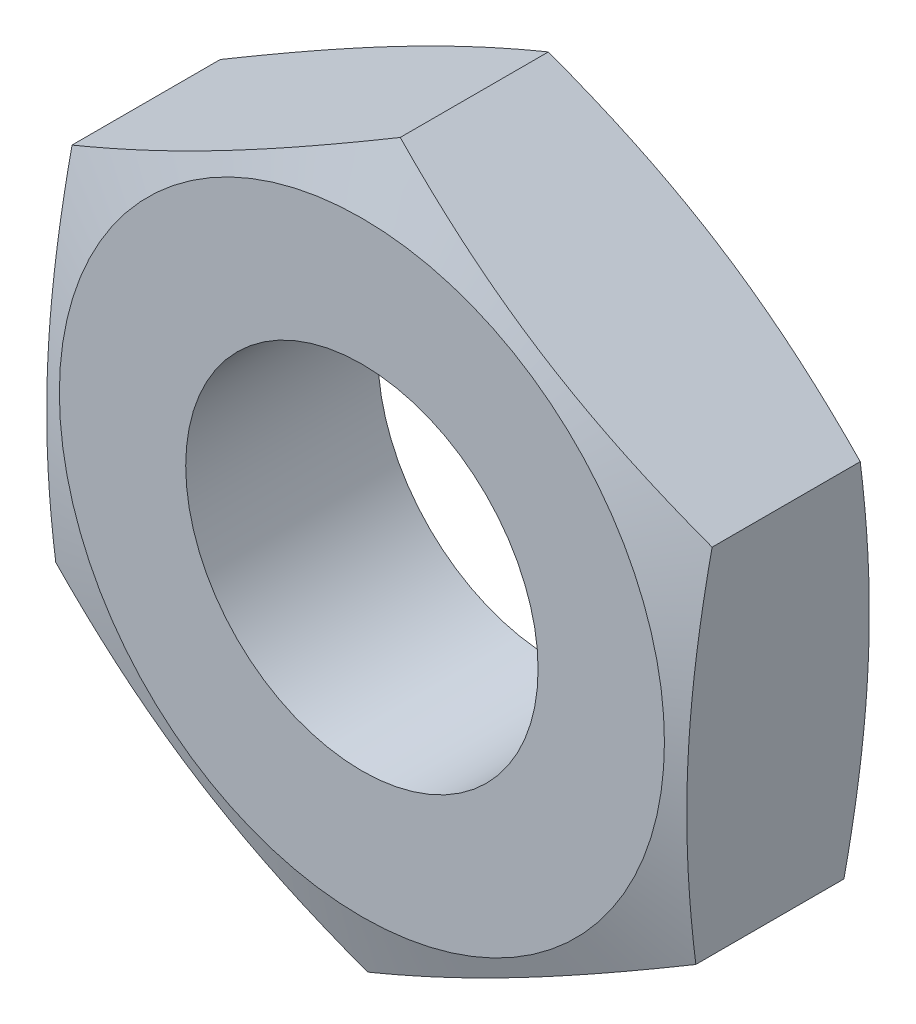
ISO-10303-21;
HEADER;
FILE_DESCRIPTION(('STEP AP214'),'2;1');
FILE_NAME('part.step','',(''),(''),'','','');
FILE_SCHEMA(('AUTOMOTIVE_DESIGN { 1 0 10303 214 1 1 1 1 }'));
ENDSEC;
DATA;
#1=APPLICATION_CONTEXT('core data for automotive mechanical design processes');
#2=APPLICATION_PROTOCOL_DEFINITION('international standard','automotive_design',2000,#1);
#3=PRODUCT_CONTEXT('',#1,'mechanical');
#4=PRODUCT('Part','Part','',(#3));
#5=PRODUCT_RELATED_PRODUCT_CATEGORY('part','',(#4));
#6=PRODUCT_DEFINITION_FORMATION('','',#4);
#7=PRODUCT_DEFINITION_CONTEXT('part definition',#1,'design');
#8=PRODUCT_DEFINITION('design','',#6,#7);
#9=PRODUCT_DEFINITION_SHAPE('','',#8);
#10=(LENGTH_UNIT() NAMED_UNIT(*) SI_UNIT(.MILLI.,.METRE.));
#11=(NAMED_UNIT(*) PLANE_ANGLE_UNIT() SI_UNIT($,.RADIAN.));
#12=(NAMED_UNIT(*) SI_UNIT($,.STERADIAN.) SOLID_ANGLE_UNIT());
#13=UNCERTAINTY_MEASURE_WITH_UNIT(LENGTH_MEASURE(1.E-05),#10,'distance_accuracy_value','');
#14=(GEOMETRIC_REPRESENTATION_CONTEXT(3) GLOBAL_UNCERTAINTY_ASSIGNED_CONTEXT((#13)) GLOBAL_UNIT_ASSIGNED_CONTEXT((#10,
#11,#12)) REPRESENTATION_CONTEXT('',''));
#15=CARTESIAN_POINT('',(0.,0.,0.));
#16=DIRECTION('',(0.,0.,1.));
#17=DIRECTION('',(1.,0.,0.));
#18=AXIS2_PLACEMENT_3D('',#15,#16,#17);
#19=CARTESIAN_POINT('',(-38.9,6.,-25.446020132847));
#20=DIRECTION('',(0.,0.,-1.));
#21=DIRECTION('',(-1.,0.,0.));
#22=AXIS2_PLACEMENT_3D('',#19,#20,#21);
#23=CONICAL_SURFACE('',#22,5.77981137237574,1.25464201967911);
#24=CARTESIAN_POINT('',(-38.9,6.,-25.0999999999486));
#25=DIRECTION('',(0.,0.,-1.));
#26=DIRECTION('',(-1.,0.,0.));
#27=AXIS2_PLACEMENT_3D('',#24,#25,#26);
#28=CIRCLE('',#27,4.72205597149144);
#29=CARTESIAN_POINT('',(-43.6220559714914,6.,-25.0999999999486));
#30=VERTEX_POINT('',#29);
#31=EDGE_CURVE('E93',#30,#30,#28,.F.);
#32=ORIENTED_EDGE('',*,*,#31,.F.);
#33=EDGE_LOOP('',(#32));
#34=FACE_BOUND('',#33,.T.);
#35=CARTESIAN_POINT('',(-33.7777723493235,8.66385383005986,-25.4439563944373));
#36=CARTESIAN_POINT('',(-33.7789109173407,8.63801402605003,-25.4397259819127));
#37=CARTESIAN_POINT('',(-33.7800497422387,8.61216839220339,-25.4355370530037));
#38=CARTESIAN_POINT('',(-33.7823275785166,8.5604728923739,-25.4272456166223));
#39=CARTESIAN_POINT('',(-33.7834665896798,8.53462303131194,-25.4231430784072));
#40=CARTESIAN_POINT('',(-33.8049246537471,8.04763221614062,-25.3466951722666));
#41=CARTESIAN_POINT('',(-33.8253520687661,7.58403198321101,-25.2881106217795));
#42=CARTESIAN_POINT('',(-33.8561012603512,6.88617900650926,-25.2289345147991));
#43=CARTESIAN_POINT('',(-33.8663717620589,6.65308994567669,-25.2139924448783));
#44=CARTESIAN_POINT('',(-33.8869317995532,6.18647984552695,-25.1945847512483));
#45=CARTESIAN_POINT('',(-33.8972213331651,5.95295885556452,-25.190117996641));
#46=CARTESIAN_POINT('',(-33.9179225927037,5.48314372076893,-25.191978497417));
#47=CARTESIAN_POINT('',(-33.9283342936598,5.24685014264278,-25.1984367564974));
#48=CARTESIAN_POINT('',(-33.9491363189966,4.77474812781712,-25.2219573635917));
#49=CARTESIAN_POINT('',(-33.9595266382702,4.53893980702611,-25.2390220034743));
#50=CARTESIAN_POINT('',(-33.9802815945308,4.06790602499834,-25.2827352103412));
#51=CARTESIAN_POINT('',(-33.9906461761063,3.83268182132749,-25.309397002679));
#52=CARTESIAN_POINT('',(-34.0113231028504,3.36341891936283,-25.3708950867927));
#53=CARTESIAN_POINT('',(-34.0216354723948,3.129379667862,-25.405727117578));
#54=CARTESIAN_POINT('',(-34.0319210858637,2.89594764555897,-25.4439563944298));
#55=B_SPLINE_CURVE_WITH_KNOTS('',3,(#35,#36,#37,#38,#39,#40,#41,#42,#43,#44,#45,#46,#47,#48,#49,
#50,#51,#52,#53,#54),.UNSPECIFIED.,.F.,.F.,(4,2,2,2,2,2,2,2,2,4),(0.,0.0786237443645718,
0.157219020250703,1.5588520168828,2.2600434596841,2.96115919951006,3.67074186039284,
4.38047790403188,5.09119576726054,5.80154379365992),.UNSPECIFIED.);
#56=CARTESIAN_POINT('',(-33.7777723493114,8.66385383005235,-25.4439563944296));
#57=VERTEX_POINT('',#56);
#58=CARTESIAN_POINT('',(-34.0319210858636,2.89594764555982,-25.4439563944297));
#59=VERTEX_POINT('',#58);
#60=EDGE_CURVE('E103',#57,#59,#55,.T.);
#61=ORIENTED_EDGE('',*,*,#60,.F.);
#62=CARTESIAN_POINT('',(-38.6458512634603,11.7679061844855,-25.4439563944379));
#63=CARTESIAN_POINT('',(-38.4440191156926,11.6392111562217,-25.4047902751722));
#64=CARTESIAN_POINT('',(-38.2416461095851,11.5101712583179,-25.3691920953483));
#65=CARTESIAN_POINT('',(-37.8358362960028,11.2514131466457,-25.3065991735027));
#66=CARTESIAN_POINT('',(-37.6323989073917,11.1216945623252,-25.2796097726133));
#67=CARTESIAN_POINT('',(-37.2262900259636,10.8627457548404,-25.2359221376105));
#68=CARTESIAN_POINT('',(-37.0236246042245,10.7335194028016,-25.2191466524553));
#69=CARTESIAN_POINT('',(-36.6179099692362,10.4748219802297,-25.1966486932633));
#70=CARTESIAN_POINT('',(-36.4148608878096,10.3453509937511,-25.1909229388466));
#71=CARTESIAN_POINT('',(-36.0087627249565,10.0864090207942,-25.1909229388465));
#72=CARTESIAN_POINT('',(-35.8057136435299,9.95693803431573,-25.1966486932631));
#73=CARTESIAN_POINT('',(-35.3999990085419,9.69824061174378,-25.2191466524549));
#74=CARTESIAN_POINT('',(-35.1973335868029,9.56901425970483,-25.2359221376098));
#75=CARTESIAN_POINT('',(-34.7912247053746,9.31006545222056,-25.2796097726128));
#76=CARTESIAN_POINT('',(-34.5877873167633,9.18034686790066,-25.3065991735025));
#77=CARTESIAN_POINT('',(-34.181977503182,8.92158875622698,-25.3691920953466));
#78=CARTESIAN_POINT('',(-33.9796044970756,8.79254885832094,-25.4047902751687));
#79=CARTESIAN_POINT('',(-33.7777723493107,8.6638538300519,-25.4439563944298));
#80=B_SPLINE_CURVE_WITH_KNOTS('',3,(#62,#63,#64,#65,#66,#67,#68,#69,#70,#71,#72,#73,#74,#75,#76,
#77,#78,#79),.UNSPECIFIED.,.F.,.F.,(4,2,2,2,2,2,2,2,4),(0.,0.727722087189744,1.45589479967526,
2.17848939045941,2.90086942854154,3.62324946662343,4.34584405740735,5.07401676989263,
5.80173885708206),.UNSPECIFIED.);
#81=CARTESIAN_POINT('',(-38.645851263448,11.7679061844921,-25.4439563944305));
#82=VERTEX_POINT('',#81);
#83=EDGE_CURVE('E107',#82,#57,#80,.T.);
#84=ORIENTED_EDGE('',*,*,#83,.F.);
#85=CARTESIAN_POINT('',(-43.7680789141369,9.10405235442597,-25.4439563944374));
#86=CARTESIAN_POINT('',(-43.5557096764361,9.21449660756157,-25.4047902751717));
#87=CARTESIAN_POINT('',(-43.342771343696,9.32523682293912,-25.3691920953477));
#88=CARTESIAN_POINT('',(-42.9157753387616,9.54729937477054,-25.3065991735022));
#89=CARTESIAN_POINT('',(-42.7017170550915,9.65862202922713,-25.2796097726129));
#90=CARTESIAN_POINT('',(-42.274406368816,9.88084823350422,-25.2359221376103));
#91=CARTESIAN_POINT('',(-42.0611603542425,9.99174846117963,-25.2191466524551));
#92=CARTESIAN_POINT('',(-41.6342644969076,10.2137589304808,-25.1966486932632));
#93=CARTESIAN_POINT('',(-41.420614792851,10.3248690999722,-25.1909229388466));
#94=CARTESIAN_POINT('',(-40.9933153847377,10.5470894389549,-25.1909229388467));
#95=CARTESIAN_POINT('',(-40.7796656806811,10.6581996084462,-25.1966486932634));
#96=CARTESIAN_POINT('',(-40.3527698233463,10.8802100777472,-25.2191466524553));
#97=CARTESIAN_POINT('',(-40.1395238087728,10.9911103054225,-25.2359221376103));
#98=CARTESIAN_POINT('',(-39.7122131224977,11.2133365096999,-25.2796097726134));
#99=CARTESIAN_POINT('',(-39.4981548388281,11.324659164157,-25.3065991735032));
#100=CARTESIAN_POINT('',(-39.0711588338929,11.5467217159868,-25.3691920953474));
#101=CARTESIAN_POINT('',(-38.8582205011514,11.6574619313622,-25.4047902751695));
#102=CARTESIAN_POINT('',(-38.6458512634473,11.7679061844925,-25.4439563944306));
#103=B_SPLINE_CURVE_WITH_KNOTS('',3,(#85,#86,#87,#88,#89,#90,#91,#92,#93,#94,#95,#96,#97,#98,
#99,#100,#101,#102),.UNSPECIFIED.,.F.,.F.,(4,2,2,2,2,2,2,2,4),(0.,0.727722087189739,
1.45589479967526,2.17848939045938,2.90086942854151,3.62324946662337,4.34584405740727,
5.07401676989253,5.80173885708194),.UNSPECIFIED.);
#104=CARTESIAN_POINT('',(-43.7680789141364,9.10405235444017,-25.4439563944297));
#105=VERTEX_POINT('',#104);
#106=EDGE_CURVE('E82',#105,#82,#103,.T.);
#107=ORIENTED_EDGE('',*,*,#106,.F.);
#108=CARTESIAN_POINT('',(-44.0222276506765,3.33614616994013,-25.4439563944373));
#109=CARTESIAN_POINT('',(-44.0210890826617,3.36198597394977,-25.4397259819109));
#110=CARTESIAN_POINT('',(-44.0199502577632,3.38783160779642,-25.4355370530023));
#111=CARTESIAN_POINT('',(-44.0176724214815,3.43952710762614,-25.4272456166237));
#112=CARTESIAN_POINT('',(-44.0165334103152,3.46537696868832,-25.4231430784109));
#113=CARTESIAN_POINT('',(-43.9950753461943,3.9523677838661,-25.3466951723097));
#114=CARTESIAN_POINT('',(-43.974647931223,4.4159680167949,-25.2881106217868));
#115=CARTESIAN_POINT('',(-43.9438987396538,5.11382099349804,-25.2289345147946));
#116=CARTESIAN_POINT('',(-43.9336282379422,5.34691005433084,-25.2139924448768));
#117=CARTESIAN_POINT('',(-43.9130682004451,5.81352015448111,-25.1945847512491));
#118=CARTESIAN_POINT('',(-43.9027786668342,6.04704114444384,-25.1901179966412));
#119=CARTESIAN_POINT('',(-43.8820774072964,6.5168562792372,-25.1919784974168));
#120=CARTESIAN_POINT('',(-43.8716657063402,6.75314985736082,-25.1984367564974));
#121=CARTESIAN_POINT('',(-43.8508636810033,7.22525187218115,-25.2219573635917));
#122=CARTESIAN_POINT('',(-43.84047336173,7.46106019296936,-25.239022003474));
#123=CARTESIAN_POINT('',(-43.8197184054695,7.93209397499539,-25.2827352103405));
#124=CARTESIAN_POINT('',(-43.809353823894,8.16731817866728,-25.3093970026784));
#125=CARTESIAN_POINT('',(-43.7886768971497,8.63658108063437,-25.3708950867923));
#126=CARTESIAN_POINT('',(-43.7783645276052,8.8706203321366,-25.4057271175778));
#127=CARTESIAN_POINT('',(-43.7680789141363,9.10405235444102,-25.4439563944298));
#128=B_SPLINE_CURVE_WITH_KNOTS('',3,(#108,#109,#110,#111,#112,#113,#114,#115,#116,#117,#118,
#119,#120,#121,#122,#123,#124,#125,#126,#127),.UNSPECIFIED.,.F.,.F.,(4,2,2,2,2,2,2,2,2,4),(0.,
0.0786237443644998,0.15721902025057,1.55885201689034,2.26004345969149,2.96115919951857,
3.67074186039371,4.38047790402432,5.0911957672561,5.8015437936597),.UNSPECIFIED.);
#129=CARTESIAN_POINT('',(-44.0222276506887,3.33614616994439,-25.4439563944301));
#130=VERTEX_POINT('',#129);
#131=EDGE_CURVE('E21',#130,#105,#128,.T.);
#132=ORIENTED_EDGE('',*,*,#131,.F.);
#133=CARTESIAN_POINT('',(-39.1541487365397,0.232093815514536,-25.4439563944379));
#134=CARTESIAN_POINT('',(-39.3559808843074,0.360788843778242,-25.4047902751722));
#135=CARTESIAN_POINT('',(-39.5583538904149,0.489828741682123,-25.3691920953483));
#136=CARTESIAN_POINT('',(-39.9641637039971,0.748586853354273,-25.3065991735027));
#137=CARTESIAN_POINT('',(-40.1676010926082,0.878305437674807,-25.2796097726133));
#138=CARTESIAN_POINT('',(-40.5737099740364,1.13725424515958,-25.2359221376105));
#139=CARTESIAN_POINT('',(-40.7763753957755,1.26648059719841,-25.2191466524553));
#140=CARTESIAN_POINT('',(-41.1820900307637,1.52517801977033,-25.1966486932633));
#141=CARTESIAN_POINT('',(-41.3851391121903,1.65464900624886,-25.1909229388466));
#142=CARTESIAN_POINT('',(-41.7912372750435,1.91359097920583,-25.1909229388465));
#143=CARTESIAN_POINT('',(-41.99428635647,2.04306196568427,-25.1966486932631));
#144=CARTESIAN_POINT('',(-42.4000009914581,2.30175938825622,-25.2191466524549));
#145=CARTESIAN_POINT('',(-42.602666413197,2.43098574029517,-25.2359221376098));
#146=CARTESIAN_POINT('',(-43.0087752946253,2.68993454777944,-25.2796097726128));
#147=CARTESIAN_POINT('',(-43.2122126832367,2.81965313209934,-25.3065991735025));
#148=CARTESIAN_POINT('',(-43.618022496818,3.07841124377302,-25.3691920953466));
#149=CARTESIAN_POINT('',(-43.8203955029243,3.20745114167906,-25.4047902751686));
#150=CARTESIAN_POINT('',(-44.0222276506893,3.3361461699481,-25.4439563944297));
#151=B_SPLINE_CURVE_WITH_KNOTS('',3,(#133,#134,#135,#136,#137,#138,#139,#140,#141,#142,#143,
#144,#145,#146,#147,#148,#149,#150),.UNSPECIFIED.,.F.,.F.,(4,2,2,2,2,2,2,2,4),(0.,
0.727722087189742,1.45589479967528,2.17848939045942,2.90086942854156,3.62324946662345,
4.34584405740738,5.07401676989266,5.80173885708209),.UNSPECIFIED.);
#152=CARTESIAN_POINT('',(-39.154148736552,0.232093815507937,-25.4439563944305));
#153=VERTEX_POINT('',#152);
#154=EDGE_CURVE('E80',#153,#130,#151,.T.);
#155=ORIENTED_EDGE('',*,*,#154,.F.);
#156=CARTESIAN_POINT('',(-34.0319210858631,2.89594764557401,-25.4439563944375));
#157=CARTESIAN_POINT('',(-34.2442903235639,2.78550339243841,-25.4047902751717));
#158=CARTESIAN_POINT('',(-34.457228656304,2.67476317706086,-25.3691920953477));
#159=CARTESIAN_POINT('',(-34.8842246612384,2.45270062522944,-25.3065991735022));
#160=CARTESIAN_POINT('',(-35.0982829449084,2.34137797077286,-25.2796097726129));
#161=CARTESIAN_POINT('',(-35.525593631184,2.11915176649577,-25.2359221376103));
#162=CARTESIAN_POINT('',(-35.7388396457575,2.00825153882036,-25.2191466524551));
#163=CARTESIAN_POINT('',(-36.1657355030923,1.78624106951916,-25.1966486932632));
#164=CARTESIAN_POINT('',(-36.379385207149,1.67513090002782,-25.1909229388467));
#165=CARTESIAN_POINT('',(-36.8066846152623,1.45291056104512,-25.1909229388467));
#166=CARTESIAN_POINT('',(-37.0203343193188,1.34180039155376,-25.1966486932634));
#167=CARTESIAN_POINT('',(-37.4472301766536,1.11978992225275,-25.2191466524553));
#168=CARTESIAN_POINT('',(-37.6604761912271,1.00888969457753,-25.2359221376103));
#169=CARTESIAN_POINT('',(-38.0877868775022,0.786663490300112,-25.2796097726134));
#170=CARTESIAN_POINT('',(-38.3018451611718,0.675340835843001,-25.3065991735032));
#171=CARTESIAN_POINT('',(-38.728841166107,0.453278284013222,-25.3691920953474));
#172=CARTESIAN_POINT('',(-38.9417794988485,0.342538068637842,-25.4047902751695));
#173=CARTESIAN_POINT('',(-39.1541487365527,0.232093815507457,-25.4439563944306));
#174=B_SPLINE_CURVE_WITH_KNOTS('',3,(#156,#157,#158,#159,#160,#161,#162,#163,#164,#165,#166,
#167,#168,#169,#170,#171,#172,#173),.UNSPECIFIED.,.F.,.F.,(4,2,2,2,2,2,2,2,4),(0.,
0.727722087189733,1.45589479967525,2.17848939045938,2.90086942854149,3.62324946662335,
4.34584405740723,5.07401676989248,5.80173885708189),.UNSPECIFIED.);
#175=EDGE_CURVE('E99',#59,#153,#174,.T.);
#176=ORIENTED_EDGE('',*,*,#175,.F.);
#177=EDGE_LOOP('',(#61,#84,#107,#132,#155,#176));
#178=FACE_BOUND('',#177,.T.);
#179=ADVANCED_FACE('F17',(#34,#178),#23,.T.);
#180=CARTESIAN_POINT('',(-43.7680789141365,9.10405235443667,-28.1));
#181=DIRECTION('',(-0.999030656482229,0.0440198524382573,0.));
#182=DIRECTION('',(-0.0440198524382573,-0.999030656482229,0.));
#183=AXIS2_PLACEMENT_3D('',#180,#181,#182);
#184=PLANE('',#183);
#185=ORIENTED_EDGE('',*,*,#131,.T.);
#186=DIRECTION('',(0.,0.,1.));
#187=VECTOR('',#186,1.);
#188=CARTESIAN_POINT('',(-43.7680789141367,9.10405235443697,-28.1));
#189=LINE('',#188,#187);
#190=CARTESIAN_POINT('',(-43.7680789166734,9.10405229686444,-27.7560436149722));
#191=VERTEX_POINT('',#190);
#192=EDGE_CURVE('E84',#191,#105,#189,.T.);
#193=ORIENTED_EDGE('',*,*,#192,.F.);
#194=CARTESIAN_POINT('',(-44.0222276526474,3.3361461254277,-27.7560435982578));
#195=CARTESIAN_POINT('',(-44.0210890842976,3.36198593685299,-27.7602740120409));
#196=CARTESIAN_POINT('',(-44.0199502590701,3.38783157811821,-27.7644629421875));
#197=CARTESIAN_POINT('',(-44.0176724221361,3.43952709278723,-27.7727543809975));
#198=CARTESIAN_POINT('',(-44.0165334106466,3.46537696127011,-27.7768569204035));
#199=CARTESIAN_POINT('',(-43.9950753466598,3.95236777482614,-27.853304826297));
#200=CARTESIAN_POINT('',(-43.9746479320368,4.41596799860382,-27.9118893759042));
#201=CARTESIAN_POINT('',(-43.9438987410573,5.11382096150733,-27.97106548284));
#202=CARTESIAN_POINT('',(-43.9336282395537,5.34691001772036,-27.9860075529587));
#203=CARTESIAN_POINT('',(-43.9130682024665,5.81352010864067,-28.0054152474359));
#204=CARTESIAN_POINT('',(-43.9027786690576,6.0470410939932,-28.0098820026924));
#205=CARTESIAN_POINT('',(-43.88207740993,6.51685621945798,-28.0080215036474));
#206=CARTESIAN_POINT('',(-43.871665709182,6.75314979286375,-28.0015632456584));
#207=CARTESIAN_POINT('',(-43.8508636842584,7.22525179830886,-27.9780426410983));
#208=CARTESIAN_POINT('',(-43.8404733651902,7.46106011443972,-27.9609780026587));
#209=CARTESIAN_POINT('',(-43.8197184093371,7.93209388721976,-27.9172647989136));
#210=CARTESIAN_POINT('',(-43.8093538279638,8.1673180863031,-27.8906030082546));
#211=CARTESIAN_POINT('',(-43.7886769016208,8.63658097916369,-27.8291049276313));
#212=CARTESIAN_POINT('',(-43.7783645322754,8.87062022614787,-27.7942728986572));
#213=CARTESIAN_POINT('',(-43.7680789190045,9.10405224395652,-27.7560436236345));
#214=B_SPLINE_CURVE_WITH_KNOTS('',3,(#194,#195,#196,#197,#198,#199,#200,#201,#202,#203,#204,
#205,#206,#207,#208,#209,#210,#211,#212,#213),.UNSPECIFIED.,.F.,.F.,(4,2,2,2,2,2,2,2,2,4),(0.,
0.0786237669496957,0.157219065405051,1.55885203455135,2.26004346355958,2.96115918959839,
3.67074183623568,4.38047786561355,5.09119571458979,5.8015437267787),.UNSPECIFIED.);
#215=CARTESIAN_POINT('',(-44.0222276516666,3.3361461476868,-27.7560436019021));
#216=VERTEX_POINT('',#215);
#217=EDGE_CURVE('E38',#216,#191,#214,.T.);
#218=ORIENTED_EDGE('',*,*,#217,.F.);
#219=DIRECTION('',(0.,0.,1.));
#220=VECTOR('',#219,1.);
#221=CARTESIAN_POINT('',(-44.0222276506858,3.33614616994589,-28.1));
#222=LINE('',#221,#220);
#223=EDGE_CURVE('E89',#130,#216,#222,.F.);
#224=ORIENTED_EDGE('',*,*,#223,.F.);
#225=EDGE_LOOP('',(#185,#193,#218,#224));
#226=FACE_BOUND('',#225,.T.);
#227=ADVANCED_FACE('F92',(#226),#184,.T.);
#228=CARTESIAN_POINT('',(-38.6458512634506,11.7679061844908,-28.1));
#229=DIRECTION('',(-0.461393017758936,0.887195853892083,0.));
#230=DIRECTION('',(-0.887195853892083,-0.461393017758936,0.));
#231=AXIS2_PLACEMENT_3D('',#228,#229,#230);
#232=PLANE('',#231);
#233=ORIENTED_EDGE('',*,*,#106,.T.);
#234=DIRECTION('',(0.,0.,1.));
#235=VECTOR('',#234,1.);
#236=CARTESIAN_POINT('',(-38.6458512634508,11.7679061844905,-28.1));
#237=LINE('',#236,#235);
#238=CARTESIAN_POINT('',(-38.645851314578,11.7679061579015,-27.7560436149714));
#239=VERTEX_POINT('',#238);
#240=EDGE_CURVE('E108',#239,#82,#237,.T.);
#241=ORIENTED_EDGE('',*,*,#240,.F.);
#242=CARTESIAN_POINT('',(-43.7680789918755,9.10405231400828,-27.7560435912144));
#243=CARTESIAN_POINT('',(-43.5557097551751,9.21449656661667,-27.7952097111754));
#244=CARTESIAN_POINT('',(-43.3427714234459,9.32523678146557,-27.8308078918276));
#245=CARTESIAN_POINT('',(-42.9157754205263,9.54729933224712,-27.893400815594));
#246=CARTESIAN_POINT('',(-42.70171713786,9.65862198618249,-27.9203902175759));
#247=CARTESIAN_POINT('',(-42.2744064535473,9.88084818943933,-27.964077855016));
#248=CARTESIAN_POINT('',(-42.0611604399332,9.99174841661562,-27.9808533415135));
#249=CARTESIAN_POINT('',(-41.6342645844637,10.2137588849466,-28.0033513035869));
#250=CARTESIAN_POINT('',(-41.420614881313,10.3248690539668,-28.0090770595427));
#251=CARTESIAN_POINT('',(-40.9933154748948,10.547089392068,-28.0090770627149));
#252=CARTESIAN_POINT('',(-40.7796657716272,10.658199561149,-28.0033513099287));
#253=CARTESIAN_POINT('',(-40.3527699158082,10.8802100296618,-27.9808533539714));
#254=CARTESIAN_POINT('',(-40.1395239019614,10.991110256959,-27.9640778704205));
#255=CARTESIAN_POINT('',(-39.7122132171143,11.2133364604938,-27.9203902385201));
#256=CARTESIAN_POINT('',(-39.4981549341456,11.3246591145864,-27.8934008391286));
#257=CARTESIAN_POINT('',(-39.0711589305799,11.546721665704,-27.8308079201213));
#258=CARTESIAN_POINT('',(-38.8582205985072,11.6574618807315,-27.7952097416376));
#259=CARTESIAN_POINT('',(-38.6458513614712,11.7679061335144,-27.7560436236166));
#260=B_SPLINE_CURVE_WITH_KNOTS('',3,(#242,#243,#244,#245,#246,#247,#248,#249,#250,#251,#252,
#253,#254,#255,#256,#257,#258,#259),.UNSPECIFIED.,.F.,.F.,(4,2,2,2,2,2,2,2,4),(0.,
0.727722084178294,1.45589479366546,2.17848938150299,2.90086941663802,3.62324945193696,
4.34584403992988,5.07401674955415,5.80173883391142),.UNSPECIFIED.);
#261=EDGE_CURVE('E184',#191,#239,#260,.T.);
#262=ORIENTED_EDGE('',*,*,#261,.F.);
#263=ORIENTED_EDGE('',*,*,#192,.T.);
#264=EDGE_LOOP('',(#233,#241,#262,#263));
#265=FACE_BOUND('',#264,.T.);
#266=ADVANCED_FACE('F193',(#265),#232,.T.);
#267=CARTESIAN_POINT('',(-33.7777723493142,8.6638538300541,-28.1));
#268=DIRECTION('',(0.537637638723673,0.843176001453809,0.));
#269=DIRECTION('',(-0.843176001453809,0.537637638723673,0.));
#270=AXIS2_PLACEMENT_3D('',#267,#268,#269);
#271=PLANE('',#270);
#272=ORIENTED_EDGE('',*,*,#83,.T.);
#273=DIRECTION('',(0.,0.,1.));
#274=VECTOR('',#273,1.);
#275=CARTESIAN_POINT('',(-33.7777723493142,8.6638538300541,-28.1));
#276=LINE('',#275,#274);
#277=CARTESIAN_POINT('',(-33.7777723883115,8.6638538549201,-27.7560436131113));
#278=VERTEX_POINT('',#277);
#279=EDGE_CURVE('E104',#278,#57,#276,.T.);
#280=ORIENTED_EDGE('',*,*,#279,.F.);
#281=CARTESIAN_POINT('',(-38.6458513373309,11.7679062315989,-27.756043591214));
#282=CARTESIAN_POINT('',(-38.4440191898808,11.6392112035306,-27.7952097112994));
#283=CARTESIAN_POINT('',(-38.2416461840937,11.5101713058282,-27.8308078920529));
#284=CARTESIAN_POINT('',(-37.8358363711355,11.2514131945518,-27.893400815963));
#285=CARTESIAN_POINT('',(-37.632398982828,11.1216946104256,-27.920390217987));
#286=CARTESIAN_POINT('',(-37.226290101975,10.8627458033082,-27.9640778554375));
#287=CARTESIAN_POINT('',(-37.0236246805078,10.7335194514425,-27.9808533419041));
#288=CARTESIAN_POINT('',(-36.6179100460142,10.4748220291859,-28.0033513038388));
#289=CARTESIAN_POINT('',(-36.4148609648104,10.3453510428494,-28.0090770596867));
#290=CARTESIAN_POINT('',(-36.0087628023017,10.0864090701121,-28.0090770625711));
#291=CARTESIAN_POINT('',(-35.8057137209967,9.9569380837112,-28.0033513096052));
#292=CARTESIAN_POINT('',(-35.3999990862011,9.69824066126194,-27.9808533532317));
#293=CARTESIAN_POINT('',(-35.1973336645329,9.56901430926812,-27.9640778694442));
#294=CARTESIAN_POINT('',(-34.7912247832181,9.31006550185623,-27.9203902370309));
#295=CARTESIAN_POINT('',(-34.5877873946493,9.1803469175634,-27.8934008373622));
#296=CARTESIAN_POINT('',(-34.1819775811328,8.92158880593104,-27.8308079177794));
#297=CARTESIAN_POINT('',(-33.9796045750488,8.79254890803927,-27.7952097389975));
#298=CARTESIAN_POINT('',(-33.7777724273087,8.6638538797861,-27.7560436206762));
#299=B_SPLINE_CURVE_WITH_KNOTS('',3,(#281,#282,#283,#284,#285,#286,#287,#288,#289,#290,#291,
#292,#293,#294,#295,#296,#297,#298),.UNSPECIFIED.,.F.,.F.,(4,2,2,2,2,2,2,2,4),(0.,
0.727722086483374,1.45589479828,2.17848938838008,2.90086942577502,3.62324946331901,
4.34584405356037,5.07401676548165,5.80173885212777),.UNSPECIFIED.);
#300=EDGE_CURVE('E177',#239,#278,#299,.T.);
#301=ORIENTED_EDGE('',*,*,#300,.F.);
#302=ORIENTED_EDGE('',*,*,#240,.T.);
#303=EDGE_LOOP('',(#272,#280,#301,#302));
#304=FACE_BOUND('',#303,.T.);
#305=ADVANCED_FACE('F166',(#304),#271,.T.);
#306=CARTESIAN_POINT('',(-34.0319210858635,2.89594764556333,-28.1));
#307=DIRECTION('',(0.999030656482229,-0.0440198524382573,0.));
#308=DIRECTION('',(0.0440198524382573,0.999030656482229,0.));
#309=AXIS2_PLACEMENT_3D('',#306,#307,#308);
#310=PLANE('',#309);
#311=ORIENTED_EDGE('',*,*,#60,.T.);
#312=DIRECTION('',(0.,0.,1.));
#313=VECTOR('',#312,1.);
#314=CARTESIAN_POINT('',(-34.0319210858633,2.89594764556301,-28.1));
#315=LINE('',#314,#313);
#316=CARTESIAN_POINT('',(-34.0319210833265,2.89594770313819,-27.7560436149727));
#317=VERTEX_POINT('',#316);
#318=EDGE_CURVE('E100',#317,#59,#315,.T.);
#319=ORIENTED_EDGE('',*,*,#318,.F.);
#320=CARTESIAN_POINT('',(-33.7777723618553,8.66385394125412,-27.7560435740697));
#321=CARTESIAN_POINT('',(-33.7789109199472,8.63801411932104,-27.7602739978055));
#322=CARTESIAN_POINT('',(-33.7800497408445,8.61216846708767,-27.7644629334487));
#323=CARTESIAN_POINT('',(-33.7823275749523,8.56047293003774,-27.7727543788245));
#324=CARTESIAN_POINT('',(-33.7834665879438,8.53462305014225,-27.7768569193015));
#325=CARTESIAN_POINT('',(-33.8049246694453,8.04763222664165,-27.8533048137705));
#326=CARTESIAN_POINT('',(-33.8253520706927,7.58403200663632,-27.9118893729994));
#327=CARTESIAN_POINT('',(-33.8561012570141,6.88617904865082,-27.9710654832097));
#328=CARTESIAN_POINT('',(-33.8663717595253,6.65308999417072,-27.986007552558));
#329=CARTESIAN_POINT('',(-33.8869317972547,6.18647990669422,-28.0054152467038));
#330=CARTESIAN_POINT('',(-33.8972213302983,5.95295892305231,-28.0098820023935));
#331=CARTESIAN_POINT('',(-33.9179225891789,5.48314379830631,-28.0080215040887));
#332=CARTESIAN_POINT('',(-33.9283342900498,5.24685022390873,-28.00156324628));
#333=CARTESIAN_POINT('',(-33.9491363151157,4.7747482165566,-27.9780426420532));
#334=CARTESIAN_POINT('',(-33.9595266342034,4.53893989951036,-27.9609780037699));
#335=CARTESIAN_POINT('',(-33.9802815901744,4.06790612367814,-27.9172648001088));
#336=CARTESIAN_POINT('',(-33.9906461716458,3.83268192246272,-27.8906030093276));
#337=CARTESIAN_POINT('',(-34.0113230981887,3.36341902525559,-27.8291049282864));
#338=CARTESIAN_POINT('',(-34.0216354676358,3.12937977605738,-27.7942728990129));
#339=CARTESIAN_POINT('',(-34.0319210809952,2.89594775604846,-27.7560436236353));
#340=B_SPLINE_CURVE_WITH_KNOTS('',3,(#320,#321,#322,#323,#324,#325,#326,#327,#328,#329,#330,
#331,#332,#333,#334,#335,#336,#337,#338,#339),.UNSPECIFIED.,.F.,.F.,(4,2,2,2,2,2,2,2,2,4),(0.,
0.0786238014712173,0.157219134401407,1.55885209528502,2.26004351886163,2.96115923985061,
3.67074188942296,4.38047792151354,5.09119577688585,5.80154379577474),.UNSPECIFIED.);
#341=EDGE_CURVE('E171',#278,#317,#340,.T.);
#342=ORIENTED_EDGE('',*,*,#341,.F.);
#343=ORIENTED_EDGE('',*,*,#279,.T.);
#344=EDGE_LOOP('',(#311,#319,#342,#343));
#345=FACE_BOUND('',#344,.T.);
#346=ADVANCED_FACE('F163',(#345),#310,.T.);
#347=CARTESIAN_POINT('',(-39.1541487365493,0.232093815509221,-28.1));
#348=DIRECTION('',(0.461393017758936,-0.887195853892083,0.));
#349=DIRECTION('',(0.887195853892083,0.461393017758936,0.));
#350=AXIS2_PLACEMENT_3D('',#347,#348,#349);
#351=PLANE('',#350);
#352=ORIENTED_EDGE('',*,*,#175,.T.);
#353=DIRECTION('',(0.,0.,1.));
#354=VECTOR('',#353,1.);
#355=CARTESIAN_POINT('',(-39.1541487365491,0.232093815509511,-28.1));
#356=LINE('',#355,#354);
#357=CARTESIAN_POINT('',(-39.1541486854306,0.232093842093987,-27.7560436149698));
#358=VERTEX_POINT('',#357);
#359=EDGE_CURVE('E90',#358,#153,#356,.T.);
#360=ORIENTED_EDGE('',*,*,#359,.F.);
#361=CARTESIAN_POINT('',(-34.0319210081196,2.89594768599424,-27.7560435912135));
#362=CARTESIAN_POINT('',(-34.2442902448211,2.78550343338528,-27.7952097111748));
#363=CARTESIAN_POINT('',(-34.4572285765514,2.67476321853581,-27.8308078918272));
#364=CARTESIAN_POINT('',(-34.8842245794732,2.45270066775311,-27.8934008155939));
#365=CARTESIAN_POINT('',(-35.0982828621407,2.34137801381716,-27.920390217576));
#366=CARTESIAN_POINT('',(-35.5255935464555,2.11915181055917,-27.9640778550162));
#367=CARTESIAN_POINT('',(-35.7388395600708,2.00825158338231,-27.9808533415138));
#368=CARTESIAN_POINT('',(-36.1657354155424,1.78624111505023,-28.0033513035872));
#369=CARTESIAN_POINT('',(-36.3793851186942,1.67513094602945,-28.0090770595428));
#370=CARTESIAN_POINT('',(-36.8066845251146,1.45291060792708,-28.0090770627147));
#371=CARTESIAN_POINT('',(-37.0203342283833,1.34180043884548,-28.0033513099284));
#372=CARTESIAN_POINT('',(-37.4472300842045,1.11978997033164,-27.9808533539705));
#373=CARTESIAN_POINT('',(-37.6604760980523,1.00888974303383,-27.9640778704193));
#374=CARTESIAN_POINT('',(-38.0877867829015,0.786663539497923,-27.9203902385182));
#375=CARTESIAN_POINT('',(-38.3018450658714,0.675340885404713,-27.8934008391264));
#376=CARTESIAN_POINT('',(-38.7288410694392,0.453278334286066,-27.8308079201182));
#377=CARTESIAN_POINT('',(-38.941779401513,0.342538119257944,-27.7952097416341));
#378=CARTESIAN_POINT('',(-39.15414863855,0.232093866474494,-27.7560436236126));
#379=B_SPLINE_CURVE_WITH_KNOTS('',3,(#361,#362,#363,#364,#365,#366,#367,#368,#369,#370,#371,
#372,#373,#374,#375,#376,#377,#378),.UNSPECIFIED.,.F.,.F.,(4,2,2,2,2,2,2,2,4),(0.,
0.727722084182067,1.45589479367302,2.17848938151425,2.90086941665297,3.6232494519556,
4.34584403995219,5.07401674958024,5.80173883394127),.UNSPECIFIED.);
#380=EDGE_CURVE('E47',#317,#358,#379,.T.);
#381=ORIENTED_EDGE('',*,*,#380,.F.);
#382=ORIENTED_EDGE('',*,*,#318,.T.);
#383=EDGE_LOOP('',(#352,#360,#381,#382));
#384=FACE_BOUND('',#383,.T.);
#385=ADVANCED_FACE('F138',(#384),#351,.T.);
#386=CARTESIAN_POINT('',(-44.0222276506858,3.33614616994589,-28.1));
#387=DIRECTION('',(-0.537637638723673,-0.843176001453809,0.));
#388=DIRECTION('',(0.843176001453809,-0.537637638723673,0.));
#389=AXIS2_PLACEMENT_3D('',#386,#387,#388);
#390=PLANE('',#389);
#391=ORIENTED_EDGE('',*,*,#154,.T.);
#392=ORIENTED_EDGE('',*,*,#223,.T.);
#393=CARTESIAN_POINT('',(-39.1541486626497,0.23209376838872,-27.7560435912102));
#394=CARTESIAN_POINT('',(-39.3559808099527,0.360788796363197,-27.7952097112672));
#395=CARTESIAN_POINT('',(-39.5583538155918,0.48982869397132,-27.8308078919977));
#396=CARTESIAN_POINT('',(-39.9641636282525,0.748586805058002,-27.8934008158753));
#397=CARTESIAN_POINT('',(-40.1676010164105,0.878305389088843,-27.9203902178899));
#398=CARTESIAN_POINT('',(-40.5737098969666,1.13725419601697,-27.9640778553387));
#399=CARTESIAN_POINT('',(-40.7763753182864,1.26648054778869,-27.9808533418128));
#400=CARTESIAN_POINT('',(-41.1820899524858,1.52517796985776,-28.0033513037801));
#401=CARTESIAN_POINT('',(-41.3851390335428,1.65464895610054,-28.0090770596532));
#402=CARTESIAN_POINT('',(-41.7912371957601,1.91359092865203,-28.0090770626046));
#403=CARTESIAN_POINT('',(-41.9942862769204,2.04306191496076,-28.0033513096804));
#404=CARTESIAN_POINT('',(-42.4000009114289,2.3017593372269,-27.9808533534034));
#405=CARTESIAN_POINT('',(-42.6026663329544,2.43098568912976,-27.9640778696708));
#406=CARTESIAN_POINT('',(-43.0087752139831,2.68993449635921,-27.9203902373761));
#407=CARTESIAN_POINT('',(-43.2122126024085,2.81965308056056,-27.8934008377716));
#408=CARTESIAN_POINT('',(-43.6180224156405,3.07841119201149,-27.8308079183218));
#409=CARTESIAN_POINT('',(-43.8203954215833,3.2074510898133,-27.7952097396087));
#410=CARTESIAN_POINT('',(-44.022227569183,3.33614611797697,-27.7560436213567));
#411=B_SPLINE_CURVE_WITH_KNOTS('',3,(#393,#394,#395,#396,#397,#398,#399,#400,#401,#402,#403,
#404,#405,#406,#407,#408,#409,#410),.UNSPECIFIED.,.F.,.F.,(4,2,2,2,2,2,2,2,4),(0.,
0.727722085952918,1.45589479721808,2.17848938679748,2.90086942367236,3.62324946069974,
4.34584405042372,5.07401676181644,5.80173884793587),.UNSPECIFIED.);
#412=EDGE_CURVE('E117',#358,#216,#411,.T.);
#413=ORIENTED_EDGE('',*,*,#412,.F.);
#414=ORIENTED_EDGE('',*,*,#359,.T.);
#415=EDGE_LOOP('',(#391,#392,#413,#414));
#416=FACE_BOUND('',#415,.T.);
#417=ADVANCED_FACE('F87',(#416),#390,.T.);
#418=CARTESIAN_POINT('',(-38.9,6.,-25.1));
#419=DIRECTION('',(0.,0.,1.));
#420=DIRECTION('',(1.,0.,0.));
#421=AXIS2_PLACEMENT_3D('',#418,#419,#420);
#422=PLANE('',#421);
#423=CARTESIAN_POINT('',(-38.9,6.,-25.1));
#424=DIRECTION('',(0.,0.,1.));
#425=DIRECTION('',(1.,0.,0.));
#426=AXIS2_PLACEMENT_3D('',#423,#424,#425);
#427=CIRCLE('',#426,2.75);
#428=CARTESIAN_POINT('',(-36.15,6.,-25.1));
#429=VERTEX_POINT('',#428);
#430=EDGE_CURVE('E114',#429,#429,#427,.F.);
#431=ORIENTED_EDGE('',*,*,#430,.T.);
#432=EDGE_LOOP('',(#431));
#433=FACE_BOUND('',#432,.T.);
#434=ORIENTED_EDGE('',*,*,#31,.T.);
#435=EDGE_LOOP('',(#434));
#436=FACE_BOUND('',#435,.T.);
#437=ADVANCED_FACE('F137',(#433,#436),#422,.T.);
#438=CARTESIAN_POINT('',(-38.9,6.,-27.7539798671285));
#439=DIRECTION('',(0.,0.,1.));
#440=DIRECTION('',(1.,0.,0.));
#441=AXIS2_PLACEMENT_3D('',#438,#439,#440);
#442=CONICAL_SURFACE('',#441,5.77981137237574,1.25464201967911);
#443=ORIENTED_EDGE('',*,*,#300,.T.);
#444=ORIENTED_EDGE('',*,*,#341,.T.);
#445=ORIENTED_EDGE('',*,*,#380,.T.);
#446=ORIENTED_EDGE('',*,*,#412,.T.);
#447=ORIENTED_EDGE('',*,*,#217,.T.);
#448=ORIENTED_EDGE('',*,*,#261,.T.);
#449=EDGE_LOOP('',(#443,#444,#445,#446,#447,#448));
#450=FACE_BOUND('',#449,.T.);
#451=CARTESIAN_POINT('',(-38.9,6.,-28.1000000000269));
#452=DIRECTION('',(0.,0.,1.));
#453=DIRECTION('',(1.,0.,0.));
#454=AXIS2_PLACEMENT_3D('',#451,#452,#453);
#455=CIRCLE('',#454,4.72205597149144);
#456=CARTESIAN_POINT('',(-34.1779440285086,6.,-28.1000000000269));
#457=VERTEX_POINT('',#456);
#458=EDGE_CURVE('E30',#457,#457,#455,.T.);
#459=ORIENTED_EDGE('',*,*,#458,.T.);
#460=EDGE_LOOP('',(#459));
#461=FACE_BOUND('',#460,.T.);
#462=ADVANCED_FACE('F131',(#450,#461),#442,.T.);
#463=CARTESIAN_POINT('',(-38.9,6.,-26.6));
#464=DIRECTION('',(0.,0.,1.));
#465=DIRECTION('',(1.,0.,0.));
#466=AXIS2_PLACEMENT_3D('',#463,#464,#465);
#467=CYLINDRICAL_SURFACE('',#466,2.75);
#468=CARTESIAN_POINT('',(-38.9,6.,-28.1));
#469=DIRECTION('',(0.,0.,1.));
#470=DIRECTION('',(1.,0.,0.));
#471=AXIS2_PLACEMENT_3D('',#468,#469,#470);
#472=CIRCLE('',#471,2.75);
#473=CARTESIAN_POINT('',(-36.15,6.,-28.1));
#474=VERTEX_POINT('',#473);
#475=EDGE_CURVE('E11',#474,#474,#472,.F.);
#476=ORIENTED_EDGE('',*,*,#475,.T.);
#477=EDGE_LOOP('',(#476));
#478=FACE_BOUND('',#477,.T.);
#479=ORIENTED_EDGE('',*,*,#430,.F.);
#480=EDGE_LOOP('',(#479));
#481=FACE_BOUND('',#480,.T.);
#482=ADVANCED_FACE('F213',(#478,#481),#467,.F.);
#483=CARTESIAN_POINT('',(-38.9,6.,-28.1));
#484=DIRECTION('',(0.,0.,1.));
#485=DIRECTION('',(1.,0.,0.));
#486=AXIS2_PLACEMENT_3D('',#483,#484,#485);
#487=PLANE('',#486);
#488=ORIENTED_EDGE('',*,*,#475,.F.);
#489=EDGE_LOOP('',(#488));
#490=FACE_BOUND('',#489,.T.);
#491=ORIENTED_EDGE('',*,*,#458,.F.);
#492=EDGE_LOOP('',(#491));
#493=FACE_BOUND('',#492,.T.);
#494=ADVANCED_FACE('F216',(#490,#493),#487,.F.);
#495=CLOSED_SHELL('',(#179,#227,#266,#305,#346,#385,#417,#437,#462,#482,#494));
#496=MANIFOLD_SOLID_BREP('B1',#495);
#497=ADVANCED_BREP_SHAPE_REPRESENTATION('',(#18,#496),#14);
#498=SHAPE_DEFINITION_REPRESENTATION(#9,#497);
ENDSEC;
END-ISO-10303-21;
